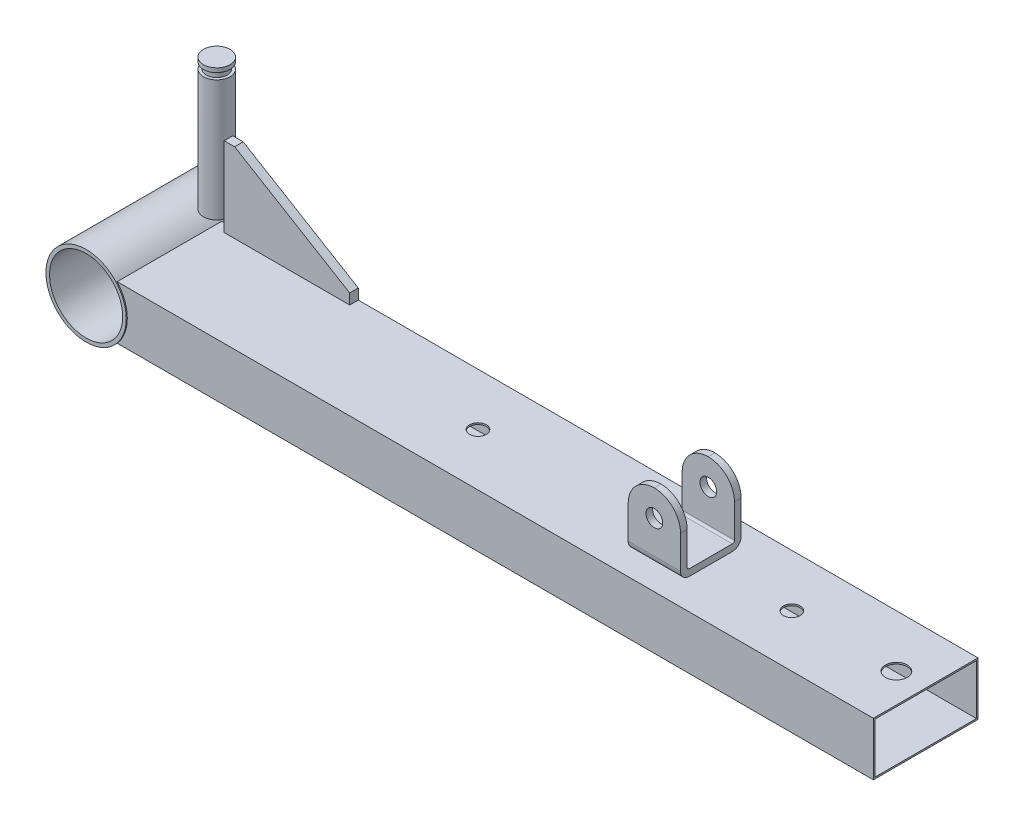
ISO-10303-21;
HEADER;
FILE_DESCRIPTION(('STEP AP214'),'2;1');
FILE_NAME('part.step','',(''),(''),'','','');
FILE_SCHEMA(('AUTOMOTIVE_DESIGN { 1 0 10303 214 1 1 1 1 }'));
ENDSEC;
DATA;
#1=APPLICATION_CONTEXT('core data for automotive mechanical design processes');
#2=APPLICATION_PROTOCOL_DEFINITION('international standard','automotive_design',2000,#1);
#3=PRODUCT_CONTEXT('',#1,'mechanical');
#4=PRODUCT('Part','Part','',(#3));
#5=PRODUCT_RELATED_PRODUCT_CATEGORY('part','',(#4));
#6=PRODUCT_DEFINITION_FORMATION('','',#4);
#7=PRODUCT_DEFINITION_CONTEXT('part definition',#1,'design');
#8=PRODUCT_DEFINITION('design','',#6,#7);
#9=PRODUCT_DEFINITION_SHAPE('','',#8);
#10=(LENGTH_UNIT() NAMED_UNIT(*) SI_UNIT(.MILLI.,.METRE.));
#11=(NAMED_UNIT(*) PLANE_ANGLE_UNIT() SI_UNIT($,.RADIAN.));
#12=(NAMED_UNIT(*) SI_UNIT($,.STERADIAN.) SOLID_ANGLE_UNIT());
#13=UNCERTAINTY_MEASURE_WITH_UNIT(LENGTH_MEASURE(1.E-05),#10,'distance_accuracy_value','');
#14=(GEOMETRIC_REPRESENTATION_CONTEXT(3) GLOBAL_UNCERTAINTY_ASSIGNED_CONTEXT((#13)) GLOBAL_UNIT_ASSIGNED_CONTEXT((#10,
#11,#12)) REPRESENTATION_CONTEXT('',''));
#15=CARTESIAN_POINT('',(0.,0.,0.));
#16=DIRECTION('',(0.,0.,1.));
#17=DIRECTION('',(1.,0.,0.));
#18=AXIS2_PLACEMENT_3D('',#15,#16,#17);
#19=CARTESIAN_POINT('',(0.,0.,74.3));
#20=DIRECTION('',(0.,0.,-1.));
#21=DIRECTION('',(-1.,0.,0.));
#22=AXIS2_PLACEMENT_3D('',#19,#20,#21);
#23=CYLINDRICAL_SURFACE('',#22,19.2);
#24=CARTESIAN_POINT('',(0.,0.,0.));
#25=DIRECTION('',(0.,0.,1.));
#26=DIRECTION('',(1.,0.,0.));
#27=AXIS2_PLACEMENT_3D('',#24,#25,#26);
#28=CIRCLE('',#27,19.2);
#29=CARTESIAN_POINT('',(19.2,0.,0.));
#30=VERTEX_POINT('',#29);
#31=EDGE_CURVE('E464',#30,#30,#28,.T.);
#32=ORIENTED_EDGE('',*,*,#31,.T.);
#33=EDGE_LOOP('',(#32));
#34=FACE_BOUND('',#33,.T.);
#35=CARTESIAN_POINT('',(0.,0.,74.3));
#36=DIRECTION('',(0.,0.,1.));
#37=DIRECTION('',(1.,0.,0.));
#38=AXIS2_PLACEMENT_3D('',#35,#36,#37);
#39=CIRCLE('',#38,19.2);
#40=CARTESIAN_POINT('',(19.2,0.,74.3));
#41=VERTEX_POINT('',#40);
#42=EDGE_CURVE('E467',#41,#41,#39,.T.);
#43=ORIENTED_EDGE('',*,*,#42,.F.);
#44=EDGE_LOOP('',(#43));
#45=FACE_BOUND('',#44,.T.);
#46=DIRECTION('',(0.,0.,-1.));
#47=VECTOR('',#46,1.);
#48=CARTESIAN_POINT('',(14.3553996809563,12.75,74.3));
#49=LINE('',#48,#47);
#50=CARTESIAN_POINT('',(14.3553996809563,12.75,23.8));
#51=VERTEX_POINT('',#50);
#52=CARTESIAN_POINT('',(14.3553996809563,12.75,73.8));
#53=VERTEX_POINT('',#52);
#54=EDGE_CURVE('E438',#51,#53,#49,.F.);
#55=ORIENTED_EDGE('',*,*,#54,.F.);
#56=CARTESIAN_POINT('',(0.,0.,23.8));
#57=DIRECTION('',(0.,0.,-1.));
#58=DIRECTION('',(0.,1.,0.));
#59=AXIS2_PLACEMENT_3D('',#56,#57,#58);
#60=CIRCLE('',#59,19.2);
#61=CARTESIAN_POINT('',(14.3553996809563,-12.75,23.8));
#62=VERTEX_POINT('',#61);
#63=EDGE_CURVE('E386',#62,#51,#60,.F.);
#64=ORIENTED_EDGE('',*,*,#63,.F.);
#65=DIRECTION('',(0.,0.,-1.));
#66=VECTOR('',#65,1.);
#67=CARTESIAN_POINT('',(14.3553996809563,-12.75,74.3));
#68=LINE('',#67,#66);
#69=CARTESIAN_POINT('',(14.3553996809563,-12.75,73.8));
#70=VERTEX_POINT('',#69);
#71=EDGE_CURVE('E435',#70,#62,#68,.T.);
#72=ORIENTED_EDGE('',*,*,#71,.F.);
#73=CARTESIAN_POINT('',(0.,0.,73.8));
#74=DIRECTION('',(0.,0.,1.));
#75=DIRECTION('',(1.,0.,0.));
#76=AXIS2_PLACEMENT_3D('',#73,#74,#75);
#77=CIRCLE('',#76,19.2);
#78=EDGE_CURVE('E447',#53,#70,#77,.F.);
#79=ORIENTED_EDGE('',*,*,#78,.F.);
#80=EDGE_LOOP('',(#55,#64,#72,#79));
#81=FACE_BOUND('',#80,.T.);
#82=CARTESIAN_POINT('',(7.31966529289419,17.75,22.484111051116));
#83=CARTESIAN_POINT('',(7.25426067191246,17.7769583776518,22.6356158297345));
#84=CARTESIAN_POINT('',(7.19462853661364,17.801138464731,22.7901054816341));
#85=CARTESIAN_POINT('',(7.08742070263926,17.8441006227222,23.1039403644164));
#86=CARTESIAN_POINT('',(7.03984486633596,17.8628827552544,23.2632855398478));
#87=CARTESIAN_POINT('',(6.95727368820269,17.8952026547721,23.5856657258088));
#88=CARTESIAN_POINT('',(6.92227405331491,17.9087422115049,23.7486994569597));
#89=CARTESIAN_POINT('',(6.86517591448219,17.9307084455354,24.0773429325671));
#90=CARTESIAN_POINT('',(6.84307688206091,17.9391353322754,24.2429525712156));
#91=CARTESIAN_POINT('',(6.81198484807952,17.9509648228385,24.5757192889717));
#92=CARTESIAN_POINT('',(6.80300307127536,17.9543631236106,24.7428775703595));
#93=CARTESIAN_POINT('',(6.79826854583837,17.9561563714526,25.077407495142));
#94=CARTESIAN_POINT('',(6.80251582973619,17.9545513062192,25.2447791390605));
#95=CARTESIAN_POINT('',(6.82418935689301,17.9463248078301,25.578384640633));
#96=CARTESIAN_POINT('',(6.84160287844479,17.9397082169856,25.7446194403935));
#97=CARTESIAN_POINT('',(6.88940823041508,17.9214035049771,26.0748635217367));
#98=CARTESIAN_POINT('',(6.91979624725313,17.9097168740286,26.2388734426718));
#99=CARTESIAN_POINT('',(6.99991924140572,17.878571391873,26.5929900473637));
#100=CARTESIAN_POINT('',(7.05215928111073,17.8580891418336,26.7824518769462));
#101=CARTESIAN_POINT('',(7.14317671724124,17.8217866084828,27.0615917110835));
#102=CARTESIAN_POINT('',(7.17561048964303,17.8087619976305,27.1537616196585));
#103=CARTESIAN_POINT('',(7.24458535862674,17.7808144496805,27.3362554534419));
#104=CARTESIAN_POINT('',(7.28112634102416,17.7658915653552,27.4265794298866));
#105=CARTESIAN_POINT('',(7.31966529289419,17.75,27.515888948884));
#106=B_SPLINE_CURVE_WITH_KNOTS('',3,(#82,#83,#84,#85,#86,#87,#88,#89,#90,#91,#92,#93,#94,#95,
#96,#97,#98,#99,#100,#101,#102,#103,#104,#105),.UNSPECIFIED.,.F.,.F.,(4,2,2,2,2,2,2,2,2,2,2,4),
(0.,0.501472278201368,1.00293883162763,1.50423403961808,2.00550871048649,2.50721208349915,
3.00891669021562,3.5101371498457,4.01121038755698,4.60290613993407,4.89852623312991,
5.19413810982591),.UNSPECIFIED.);
#107=CARTESIAN_POINT('',(7.31966529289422,17.75,22.4841110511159));
#108=VERTEX_POINT('',#107);
#109=CARTESIAN_POINT('',(7.31966529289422,17.75,27.5158889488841));
#110=VERTEX_POINT('',#109);
#111=EDGE_CURVE('E34',#108,#110,#106,.T.);
#112=ORIENTED_EDGE('',*,*,#111,.F.);
#113=DIRECTION('',(0.,0.,-1.));
#114=VECTOR('',#113,1.);
#115=CARTESIAN_POINT('',(7.31966529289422,17.75,74.3));
#116=LINE('',#115,#114);
#117=EDGE_CURVE('E58',#110,#108,#116,.T.);
#118=ORIENTED_EDGE('',*,*,#117,.F.);
#119=EDGE_LOOP('',(#112,#118));
#120=FACE_BOUND('',#119,.T.);
#121=ADVANCED_FACE('F30',(#34,#45,#81,#120),#23,.T.);
#122=CARTESIAN_POINT('',(-19.201,12.75,23.8));
#123=DIRECTION('',(0.,1.,0.));
#124=DIRECTION('',(0.,0.,1.));
#125=AXIS2_PLACEMENT_3D('',#122,#123,#124);
#126=PLANE('',#125);
#127=DIRECTION('',(0.,0.,-1.));
#128=VECTOR('',#127,1.);
#129=CARTESIAN_POINT('',(19.6,12.75,27.9));
#130=LINE('',#129,#128);
#131=CARTESIAN_POINT('',(19.6,12.75,27.9));
#132=VERTEX_POINT('',#131);
#133=CARTESIAN_POINT('',(19.6,12.75,23.8));
#134=VERTEX_POINT('',#133);
#135=EDGE_CURVE('E260',#132,#134,#130,.T.);
#136=ORIENTED_EDGE('',*,*,#135,.T.);
#137=DIRECTION('',(1.,0.,0.));
#138=VECTOR('',#137,1.);
#139=CARTESIAN_POINT('',(-19.201,12.75,23.8));
#140=LINE('',#139,#138);
#141=EDGE_CURVE('E245',#51,#134,#140,.T.);
#142=ORIENTED_EDGE('',*,*,#141,.F.);
#143=ORIENTED_EDGE('',*,*,#54,.T.);
#144=DIRECTION('',(1.,0.,0.));
#145=VECTOR('',#144,1.);
#146=CARTESIAN_POINT('',(-19.201,12.75,73.8));
#147=LINE('',#146,#145);
#148=CARTESIAN_POINT('',(375.8,12.75,73.8));
#149=VERTEX_POINT('',#148);
#150=EDGE_CURVE('E440',#53,#149,#147,.T.);
#151=ORIENTED_EDGE('',*,*,#150,.T.);
#152=DIRECTION('',(0.,0.,1.));
#153=VECTOR('',#152,1.);
#154=CARTESIAN_POINT('',(375.8,12.75,23.8));
#155=LINE('',#154,#153);
#156=CARTESIAN_POINT('',(375.8,12.75,23.8));
#157=VERTEX_POINT('',#156);
#158=EDGE_CURVE('E413',#157,#149,#155,.T.);
#159=ORIENTED_EDGE('',*,*,#158,.F.);
#160=CARTESIAN_POINT('',(79.6,12.75,23.8));
#161=VERTEX_POINT('',#160);
#162=EDGE_CURVE('E446',#161,#157,#140,.T.);
#163=ORIENTED_EDGE('',*,*,#162,.F.);
#164=DIRECTION('',(0.,0.,-1.));
#165=VECTOR('',#164,1.);
#166=CARTESIAN_POINT('',(79.6,12.75,27.9));
#167=LINE('',#166,#165);
#168=CARTESIAN_POINT('',(79.6,12.75,27.9));
#169=VERTEX_POINT('',#168);
#170=EDGE_CURVE('E263',#169,#161,#167,.T.);
#171=ORIENTED_EDGE('',*,*,#170,.F.);
#172=DIRECTION('',(-1.,0.,0.));
#173=VECTOR('',#172,1.);
#174=CARTESIAN_POINT('',(19.6,12.75,27.9));
#175=LINE('',#174,#173);
#176=EDGE_CURVE('E233',#169,#132,#175,.T.);
#177=ORIENTED_EDGE('',*,*,#176,.T.);
#178=EDGE_LOOP('',(#136,#142,#143,#151,#159,#163,#171,#177));
#179=FACE_BOUND('',#178,.T.);
#180=CARTESIAN_POINT('',(161.8,12.75,48.8));
#181=DIRECTION('',(0.,1.,0.));
#182=DIRECTION('',(0.,0.,1.));
#183=AXIS2_PLACEMENT_3D('',#180,#181,#182);
#184=CIRCLE('',#183,3.99999999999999);
#185=CARTESIAN_POINT('',(161.8,12.75,52.8));
#186=VERTEX_POINT('',#185);
#187=EDGE_CURVE('E273',#186,#186,#184,.T.);
#188=ORIENTED_EDGE('',*,*,#187,.F.);
#189=EDGE_LOOP('',(#188));
#190=FACE_BOUND('',#189,.T.);
#191=CARTESIAN_POINT('',(361.8,12.75,48.8));
#192=DIRECTION('',(0.,1.,0.));
#193=DIRECTION('',(0.,0.,1.));
#194=AXIS2_PLACEMENT_3D('',#191,#192,#193);
#195=CIRCLE('',#194,5.19999999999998);
#196=CARTESIAN_POINT('',(361.8,12.75,54.));
#197=VERTEX_POINT('',#196);
#198=EDGE_CURVE('E282',#197,#197,#195,.T.);
#199=ORIENTED_EDGE('',*,*,#198,.F.);
#200=EDGE_LOOP('',(#199));
#201=FACE_BOUND('',#200,.T.);
#202=CARTESIAN_POINT('',(311.8,12.75,48.8));
#203=DIRECTION('',(0.,1.,0.));
#204=DIRECTION('',(0.,0.,1.));
#205=AXIS2_PLACEMENT_3D('',#202,#203,#204);
#206=CIRCLE('',#205,3.99999999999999);
#207=CARTESIAN_POINT('',(311.8,12.75,52.8));
#208=VERTEX_POINT('',#207);
#209=EDGE_CURVE('E294',#208,#208,#206,.T.);
#210=ORIENTED_EDGE('',*,*,#209,.F.);
#211=EDGE_LOOP('',(#210));
#212=FACE_BOUND('',#211,.T.);
#213=DIRECTION('',(1.,0.,0.));
#214=VECTOR('',#213,1.);
#215=CARTESIAN_POINT('',(248.1,12.75,59.1));
#216=LINE('',#215,#214);
#217=CARTESIAN_POINT('',(248.1,12.75,59.1));
#218=VERTEX_POINT('',#217);
#219=CARTESIAN_POINT('',(273.1,12.75,59.1));
#220=VERTEX_POINT('',#219);
#221=EDGE_CURVE('E389',#218,#220,#216,.T.);
#222=ORIENTED_EDGE('',*,*,#221,.F.);
#223=DIRECTION('',(0.,0.,-1.));
#224=VECTOR('',#223,1.);
#225=CARTESIAN_POINT('',(248.1,12.75,59.1));
#226=LINE('',#225,#224);
#227=CARTESIAN_POINT('',(248.1,12.75,38.5));
#228=VERTEX_POINT('',#227);
#229=EDGE_CURVE('E375',#218,#228,#226,.T.);
#230=ORIENTED_EDGE('',*,*,#229,.T.);
#231=DIRECTION('',(1.,0.,0.));
#232=VECTOR('',#231,1.);
#233=CARTESIAN_POINT('',(248.1,12.75,38.5));
#234=LINE('',#233,#232);
#235=CARTESIAN_POINT('',(273.1,12.75,38.5));
#236=VERTEX_POINT('',#235);
#237=EDGE_CURVE('E387',#228,#236,#234,.T.);
#238=ORIENTED_EDGE('',*,*,#237,.T.);
#239=DIRECTION('',(0.,0.,-1.));
#240=VECTOR('',#239,1.);
#241=CARTESIAN_POINT('',(273.1,12.75,59.1));
#242=LINE('',#241,#240);
#243=EDGE_CURVE('E347',#220,#236,#242,.T.);
#244=ORIENTED_EDGE('',*,*,#243,.F.);
#245=EDGE_LOOP('',(#222,#230,#238,#244));
#246=FACE_BOUND('',#245,.T.);
#247=ADVANCED_FACE('F516',(#179,#190,#201,#212,#246),#126,.T.);
#248=CARTESIAN_POINT('',(0.,0.,74.3));
#249=DIRECTION('',(0.,0.,1.));
#250=DIRECTION('',(1.,0.,0.));
#251=AXIS2_PLACEMENT_3D('',#248,#249,#250);
#252=PLANE('',#251);
#253=ORIENTED_EDGE('',*,*,#42,.T.);
#254=EDGE_LOOP('',(#253));
#255=FACE_BOUND('',#254,.T.);
#256=CARTESIAN_POINT('',(0.,0.,74.3));
#257=DIRECTION('',(0.,0.,1.));
#258=DIRECTION('',(1.,0.,0.));
#259=AXIS2_PLACEMENT_3D('',#256,#257,#258);
#260=CIRCLE('',#259,17.5);
#261=CARTESIAN_POINT('',(17.5,0.,74.3));
#262=VERTEX_POINT('',#261);
#263=EDGE_CURVE('E461',#262,#262,#260,.T.);
#264=ORIENTED_EDGE('',*,*,#263,.F.);
#265=EDGE_LOOP('',(#264));
#266=FACE_BOUND('',#265,.T.);
#267=ADVANCED_FACE('F522',(#255,#266),#252,.T.);
#268=CARTESIAN_POINT('',(0.,0.,0.));
#269=DIRECTION('',(0.,0.,1.));
#270=DIRECTION('',(1.,0.,0.));
#271=AXIS2_PLACEMENT_3D('',#268,#269,#270);
#272=PLANE('',#271);
#273=ORIENTED_EDGE('',*,*,#31,.F.);
#274=EDGE_LOOP('',(#273));
#275=FACE_BOUND('',#274,.T.);
#276=CARTESIAN_POINT('',(0.,0.,0.));
#277=DIRECTION('',(0.,0.,1.));
#278=DIRECTION('',(1.,0.,0.));
#279=AXIS2_PLACEMENT_3D('',#276,#277,#278);
#280=CIRCLE('',#279,17.5);
#281=CARTESIAN_POINT('',(17.5,0.,0.));
#282=VERTEX_POINT('',#281);
#283=EDGE_CURVE('E444',#282,#282,#280,.T.);
#284=ORIENTED_EDGE('',*,*,#283,.T.);
#285=EDGE_LOOP('',(#284));
#286=FACE_BOUND('',#285,.T.);
#287=ADVANCED_FACE('F586',(#275,#286),#272,.F.);
#288=CARTESIAN_POINT('',(0.,0.,74.3));
#289=DIRECTION('',(0.,0.,-1.));
#290=DIRECTION('',(-1.,0.,0.));
#291=AXIS2_PLACEMENT_3D('',#288,#289,#290);
#292=CYLINDRICAL_SURFACE('',#291,17.5);
#293=ORIENTED_EDGE('',*,*,#263,.T.);
#294=EDGE_LOOP('',(#293));
#295=FACE_BOUND('',#294,.T.);
#296=ORIENTED_EDGE('',*,*,#283,.F.);
#297=EDGE_LOOP('',(#296));
#298=FACE_BOUND('',#297,.T.);
#299=ADVANCED_FACE('F583',(#295,#298),#292,.F.);
#300=CARTESIAN_POINT('',(-19.201,12.75,23.8));
#301=DIRECTION('',(0.,0.,-1.));
#302=DIRECTION('',(0.,1.,0.));
#303=AXIS2_PLACEMENT_3D('',#300,#301,#302);
#304=PLANE('',#303);
#305=DIRECTION('',(1.,0.,0.));
#306=VECTOR('',#305,1.);
#307=CARTESIAN_POINT('',(-19.201,-12.75,23.8));
#308=LINE('',#307,#306);
#309=CARTESIAN_POINT('',(375.8,-12.75,23.8));
#310=VERTEX_POINT('',#309);
#311=EDGE_CURVE('E437',#62,#310,#308,.T.);
#312=ORIENTED_EDGE('',*,*,#311,.F.);
#313=ORIENTED_EDGE('',*,*,#63,.T.);
#314=ORIENTED_EDGE('',*,*,#141,.T.);
#315=DIRECTION('',(0.,1.,0.));
#316=VECTOR('',#315,1.);
#317=CARTESIAN_POINT('',(19.6,12.75,23.8));
#318=LINE('',#317,#316);
#319=CARTESIAN_POINT('',(19.6,50.75,23.8));
#320=VERTEX_POINT('',#319);
#321=EDGE_CURVE('E225',#134,#320,#318,.T.);
#322=ORIENTED_EDGE('',*,*,#321,.T.);
#323=DIRECTION('',(1.,0.,0.));
#324=VECTOR('',#323,1.);
#325=CARTESIAN_POINT('',(19.6,50.75,23.8));
#326=LINE('',#325,#324);
#327=CARTESIAN_POINT('',(24.6,50.75,23.8));
#328=VERTEX_POINT('',#327);
#329=EDGE_CURVE('E236',#320,#328,#326,.T.);
#330=ORIENTED_EDGE('',*,*,#329,.T.);
#331=DIRECTION('',(0.857492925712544,-0.514495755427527,0.));
#332=VECTOR('',#331,1.);
#333=CARTESIAN_POINT('',(24.6,50.75,23.8));
#334=LINE('',#333,#332);
#335=CARTESIAN_POINT('',(79.6,17.75,23.8));
#336=VERTEX_POINT('',#335);
#337=EDGE_CURVE('E239',#328,#336,#334,.T.);
#338=ORIENTED_EDGE('',*,*,#337,.T.);
#339=DIRECTION('',(0.,-1.,0.));
#340=VECTOR('',#339,1.);
#341=CARTESIAN_POINT('',(79.6,12.75,23.8));
#342=LINE('',#341,#340);
#343=EDGE_CURVE('E51',#336,#161,#342,.T.);
#344=ORIENTED_EDGE('',*,*,#343,.T.);
#345=ORIENTED_EDGE('',*,*,#162,.T.);
#346=DIRECTION('',(0.,1.,0.));
#347=VECTOR('',#346,1.);
#348=CARTESIAN_POINT('',(375.8,12.75,23.8));
#349=LINE('',#348,#347);
#350=EDGE_CURVE('E416',#310,#157,#349,.T.);
#351=ORIENTED_EDGE('',*,*,#350,.F.);
#352=EDGE_LOOP('',(#312,#313,#314,#322,#330,#338,#344,#345,#351));
#353=FACE_BOUND('',#352,.T.);
#354=ADVANCED_FACE('F243',(#353),#304,.T.);
#355=CARTESIAN_POINT('',(-19.201,-12.75,23.8));
#356=DIRECTION('',(0.,-1.,0.));
#357=DIRECTION('',(0.,0.,-1.));
#358=AXIS2_PLACEMENT_3D('',#355,#356,#357);
#359=PLANE('',#358);
#360=CARTESIAN_POINT('',(161.8,-12.75,48.8));
#361=DIRECTION('',(0.,-1.,0.));
#362=DIRECTION('',(0.,0.,-1.));
#363=AXIS2_PLACEMENT_3D('',#360,#361,#362);
#364=CIRCLE('',#363,5.74999999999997);
#365=CARTESIAN_POINT('',(161.8,-12.75,43.05));
#366=VERTEX_POINT('',#365);
#367=EDGE_CURVE('E270',#366,#366,#364,.T.);
#368=ORIENTED_EDGE('',*,*,#367,.F.);
#369=EDGE_LOOP('',(#368));
#370=FACE_BOUND('',#369,.T.);
#371=CARTESIAN_POINT('',(311.8,-12.75,48.8));
#372=DIRECTION('',(0.,-1.,0.));
#373=DIRECTION('',(0.,0.,-1.));
#374=AXIS2_PLACEMENT_3D('',#371,#372,#373);
#375=CIRCLE('',#374,5.74999999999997);
#376=CARTESIAN_POINT('',(311.8,-12.75,43.05));
#377=VERTEX_POINT('',#376);
#378=EDGE_CURVE('E288',#377,#377,#375,.T.);
#379=ORIENTED_EDGE('',*,*,#378,.F.);
#380=EDGE_LOOP('',(#379));
#381=FACE_BOUND('',#380,.T.);
#382=DIRECTION('',(1.,0.,0.));
#383=VECTOR('',#382,1.);
#384=CARTESIAN_POINT('',(-19.201,-12.75,73.8));
#385=LINE('',#384,#383);
#386=CARTESIAN_POINT('',(375.8,-12.75,73.8));
#387=VERTEX_POINT('',#386);
#388=EDGE_CURVE('E441',#70,#387,#385,.T.);
#389=ORIENTED_EDGE('',*,*,#388,.F.);
#390=ORIENTED_EDGE('',*,*,#71,.T.);
#391=ORIENTED_EDGE('',*,*,#311,.T.);
#392=DIRECTION('',(0.,0.,-1.));
#393=VECTOR('',#392,1.);
#394=CARTESIAN_POINT('',(375.8,-12.75,23.8));
#395=LINE('',#394,#393);
#396=EDGE_CURVE('E407',#387,#310,#395,.T.);
#397=ORIENTED_EDGE('',*,*,#396,.F.);
#398=EDGE_LOOP('',(#389,#390,#391,#397));
#399=FACE_BOUND('',#398,.T.);
#400=ADVANCED_FACE('F576',(#370,#381,#399),#359,.T.);
#401=CARTESIAN_POINT('',(-19.201,12.75,73.8));
#402=DIRECTION('',(0.,0.,1.));
#403=DIRECTION('',(1.,0.,0.));
#404=AXIS2_PLACEMENT_3D('',#401,#402,#403);
#405=PLANE('',#404);
#406=ORIENTED_EDGE('',*,*,#150,.F.);
#407=ORIENTED_EDGE('',*,*,#78,.T.);
#408=ORIENTED_EDGE('',*,*,#388,.T.);
#409=DIRECTION('',(0.,-1.,0.));
#410=VECTOR('',#409,1.);
#411=CARTESIAN_POINT('',(375.8,12.75,73.8));
#412=LINE('',#411,#410);
#413=EDGE_CURVE('E410',#149,#387,#412,.T.);
#414=ORIENTED_EDGE('',*,*,#413,.F.);
#415=EDGE_LOOP('',(#406,#407,#408,#414));
#416=FACE_BOUND('',#415,.T.);
#417=ADVANCED_FACE('F568',(#416),#405,.T.);
#418=CARTESIAN_POINT('',(-19.201,12.,24.55));
#419=DIRECTION('',(0.,0.,-1.));
#420=DIRECTION('',(0.,1.,0.));
#421=AXIS2_PLACEMENT_3D('',#418,#419,#420);
#422=PLANE('',#421);
#423=CARTESIAN_POINT('',(0.,0.,24.55));
#424=DIRECTION('',(0.,0.,-1.));
#425=DIRECTION('',(0.,1.,0.));
#426=AXIS2_PLACEMENT_3D('',#423,#424,#425);
#427=CIRCLE('',#426,19.2);
#428=CARTESIAN_POINT('',(14.9879951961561,-12.,24.55));
#429=VERTEX_POINT('',#428);
#430=CARTESIAN_POINT('',(14.9879951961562,12.,24.55));
#431=VERTEX_POINT('',#430);
#432=EDGE_CURVE('E406',#429,#431,#427,.F.);
#433=ORIENTED_EDGE('',*,*,#432,.F.);
#434=DIRECTION('',(1.,0.,0.));
#435=VECTOR('',#434,1.);
#436=CARTESIAN_POINT('',(-19.201,-12.,24.55));
#437=LINE('',#436,#435);
#438=CARTESIAN_POINT('',(375.8,-12.,24.55));
#439=VERTEX_POINT('',#438);
#440=EDGE_CURVE('E434',#429,#439,#437,.T.);
#441=ORIENTED_EDGE('',*,*,#440,.T.);
#442=DIRECTION('',(0.,1.,0.));
#443=VECTOR('',#442,1.);
#444=CARTESIAN_POINT('',(375.8,12.,24.55));
#445=LINE('',#444,#443);
#446=CARTESIAN_POINT('',(375.8,12.,24.55));
#447=VERTEX_POINT('',#446);
#448=EDGE_CURVE('E431',#439,#447,#445,.T.);
#449=ORIENTED_EDGE('',*,*,#448,.T.);
#450=DIRECTION('',(1.,0.,0.));
#451=VECTOR('',#450,1.);
#452=CARTESIAN_POINT('',(-19.201,12.,24.55));
#453=LINE('',#452,#451);
#454=EDGE_CURVE('E428',#431,#447,#453,.T.);
#455=ORIENTED_EDGE('',*,*,#454,.F.);
#456=EDGE_LOOP('',(#433,#441,#449,#455));
#457=FACE_BOUND('',#456,.T.);
#458=ADVANCED_FACE('F549',(#457),#422,.F.);
#459=CARTESIAN_POINT('',(-19.201,-12.,24.55));
#460=DIRECTION('',(0.,-1.,0.));
#461=DIRECTION('',(0.,0.,-1.));
#462=AXIS2_PLACEMENT_3D('',#459,#460,#461);
#463=PLANE('',#462);
#464=CARTESIAN_POINT('',(161.8,-12.,48.8));
#465=DIRECTION('',(0.,-1.,0.));
#466=DIRECTION('',(0.,0.,-1.));
#467=AXIS2_PLACEMENT_3D('',#464,#465,#466);
#468=CIRCLE('',#467,5.74999999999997);
#469=CARTESIAN_POINT('',(161.8,-12.,43.05));
#470=VERTEX_POINT('',#469);
#471=EDGE_CURVE('E262',#470,#470,#468,.F.);
#472=ORIENTED_EDGE('',*,*,#471,.F.);
#473=EDGE_LOOP('',(#472));
#474=FACE_BOUND('',#473,.T.);
#475=CARTESIAN_POINT('',(311.8,-12.,48.8));
#476=DIRECTION('',(0.,-1.,0.));
#477=DIRECTION('',(0.,0.,-1.));
#478=AXIS2_PLACEMENT_3D('',#475,#476,#477);
#479=CIRCLE('',#478,5.74999999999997);
#480=CARTESIAN_POINT('',(311.8,-12.,43.05));
#481=VERTEX_POINT('',#480);
#482=EDGE_CURVE('E285',#481,#481,#479,.F.);
#483=ORIENTED_EDGE('',*,*,#482,.F.);
#484=EDGE_LOOP('',(#483));
#485=FACE_BOUND('',#484,.T.);
#486=DIRECTION('',(0.,0.,-1.));
#487=VECTOR('',#486,1.);
#488=CARTESIAN_POINT('',(14.9879951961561,-12.,74.3));
#489=LINE('',#488,#487);
#490=CARTESIAN_POINT('',(14.9879951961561,-12.,73.05));
#491=VERTEX_POINT('',#490);
#492=EDGE_CURVE('E442',#491,#429,#489,.T.);
#493=ORIENTED_EDGE('',*,*,#492,.F.);
#494=DIRECTION('',(1.,0.,0.));
#495=VECTOR('',#494,1.);
#496=CARTESIAN_POINT('',(-19.201,-12.,73.05));
#497=LINE('',#496,#495);
#498=CARTESIAN_POINT('',(375.8,-12.,73.05));
#499=VERTEX_POINT('',#498);
#500=EDGE_CURVE('E424',#491,#499,#497,.T.);
#501=ORIENTED_EDGE('',*,*,#500,.T.);
#502=DIRECTION('',(0.,0.,-1.));
#503=VECTOR('',#502,1.);
#504=CARTESIAN_POINT('',(375.8,-12.,24.55));
#505=LINE('',#504,#503);
#506=EDGE_CURVE('E420',#499,#439,#505,.T.);
#507=ORIENTED_EDGE('',*,*,#506,.T.);
#508=ORIENTED_EDGE('',*,*,#440,.F.);
#509=EDGE_LOOP('',(#493,#501,#507,#508));
#510=FACE_BOUND('',#509,.T.);
#511=ADVANCED_FACE('F559',(#474,#485,#510),#463,.F.);
#512=CARTESIAN_POINT('',(-19.201,12.,73.05));
#513=DIRECTION('',(0.,0.,1.));
#514=DIRECTION('',(1.,0.,0.));
#515=AXIS2_PLACEMENT_3D('',#512,#513,#514);
#516=PLANE('',#515);
#517=CARTESIAN_POINT('',(0.,0.,73.05));
#518=DIRECTION('',(0.,0.,1.));
#519=DIRECTION('',(1.,0.,0.));
#520=AXIS2_PLACEMENT_3D('',#517,#518,#519);
#521=CIRCLE('',#520,19.2);
#522=CARTESIAN_POINT('',(14.9879951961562,12.,73.05));
#523=VERTEX_POINT('',#522);
#524=EDGE_CURVE('E405',#523,#491,#521,.F.);
#525=ORIENTED_EDGE('',*,*,#524,.F.);
#526=DIRECTION('',(1.,0.,0.));
#527=VECTOR('',#526,1.);
#528=CARTESIAN_POINT('',(-19.201,12.,73.05));
#529=LINE('',#528,#527);
#530=CARTESIAN_POINT('',(375.8,12.,73.05));
#531=VERTEX_POINT('',#530);
#532=EDGE_CURVE('E423',#523,#531,#529,.T.);
#533=ORIENTED_EDGE('',*,*,#532,.T.);
#534=DIRECTION('',(0.,-1.,0.));
#535=VECTOR('',#534,1.);
#536=CARTESIAN_POINT('',(375.8,12.,73.05));
#537=LINE('',#536,#535);
#538=EDGE_CURVE('E425',#531,#499,#537,.T.);
#539=ORIENTED_EDGE('',*,*,#538,.T.);
#540=ORIENTED_EDGE('',*,*,#500,.F.);
#541=EDGE_LOOP('',(#525,#533,#539,#540));
#542=FACE_BOUND('',#541,.T.);
#543=ADVANCED_FACE('F557',(#542),#516,.F.);
#544=CARTESIAN_POINT('',(-19.201,12.,24.55));
#545=DIRECTION('',(0.,1.,0.));
#546=DIRECTION('',(0.,0.,1.));
#547=AXIS2_PLACEMENT_3D('',#544,#545,#546);
#548=PLANE('',#547);
#549=CARTESIAN_POINT('',(161.8,12.,48.8));
#550=DIRECTION('',(0.,1.,0.));
#551=DIRECTION('',(0.,0.,1.));
#552=AXIS2_PLACEMENT_3D('',#549,#550,#551);
#553=CIRCLE('',#552,3.99999999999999);
#554=CARTESIAN_POINT('',(161.8,12.,52.8));
#555=VERTEX_POINT('',#554);
#556=EDGE_CURVE('E276',#555,#555,#553,.F.);
#557=ORIENTED_EDGE('',*,*,#556,.F.);
#558=EDGE_LOOP('',(#557));
#559=FACE_BOUND('',#558,.T.);
#560=CARTESIAN_POINT('',(361.8,12.,48.8));
#561=DIRECTION('',(0.,1.,0.));
#562=DIRECTION('',(0.,0.,1.));
#563=AXIS2_PLACEMENT_3D('',#560,#561,#562);
#564=CIRCLE('',#563,5.19999999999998);
#565=CARTESIAN_POINT('',(361.8,12.,54.));
#566=VERTEX_POINT('',#565);
#567=EDGE_CURVE('E279',#566,#566,#564,.F.);
#568=ORIENTED_EDGE('',*,*,#567,.F.);
#569=EDGE_LOOP('',(#568));
#570=FACE_BOUND('',#569,.T.);
#571=CARTESIAN_POINT('',(311.8,12.,48.8));
#572=DIRECTION('',(0.,1.,0.));
#573=DIRECTION('',(0.,0.,1.));
#574=AXIS2_PLACEMENT_3D('',#571,#572,#573);
#575=CIRCLE('',#574,3.99999999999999);
#576=CARTESIAN_POINT('',(311.8,12.,52.8));
#577=VERTEX_POINT('',#576);
#578=EDGE_CURVE('E291',#577,#577,#575,.F.);
#579=ORIENTED_EDGE('',*,*,#578,.F.);
#580=EDGE_LOOP('',(#579));
#581=FACE_BOUND('',#580,.T.);
#582=DIRECTION('',(0.,0.,-1.));
#583=VECTOR('',#582,1.);
#584=CARTESIAN_POINT('',(14.9879951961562,12.,74.3));
#585=LINE('',#584,#583);
#586=EDGE_CURVE('E403',#431,#523,#585,.F.);
#587=ORIENTED_EDGE('',*,*,#586,.F.);
#588=ORIENTED_EDGE('',*,*,#454,.T.);
#589=DIRECTION('',(0.,0.,1.));
#590=VECTOR('',#589,1.);
#591=CARTESIAN_POINT('',(375.8,12.,24.55));
#592=LINE('',#591,#590);
#593=EDGE_CURVE('E419',#447,#531,#592,.T.);
#594=ORIENTED_EDGE('',*,*,#593,.T.);
#595=ORIENTED_EDGE('',*,*,#532,.F.);
#596=EDGE_LOOP('',(#587,#588,#594,#595));
#597=FACE_BOUND('',#596,.T.);
#598=ADVANCED_FACE('F537',(#559,#570,#581,#597),#548,.F.);
#599=CARTESIAN_POINT('',(375.8,-12.75,23.8));
#600=DIRECTION('',(-1.,0.,0.));
#601=DIRECTION('',(0.,0.,1.));
#602=AXIS2_PLACEMENT_3D('',#599,#600,#601);
#603=PLANE('',#602);
#604=ORIENTED_EDGE('',*,*,#593,.F.);
#605=ORIENTED_EDGE('',*,*,#448,.F.);
#606=ORIENTED_EDGE('',*,*,#506,.F.);
#607=ORIENTED_EDGE('',*,*,#538,.F.);
#608=EDGE_LOOP('',(#604,#605,#606,#607));
#609=FACE_BOUND('',#608,.T.);
#610=ORIENTED_EDGE('',*,*,#350,.T.);
#611=ORIENTED_EDGE('',*,*,#158,.T.);
#612=ORIENTED_EDGE('',*,*,#413,.T.);
#613=ORIENTED_EDGE('',*,*,#396,.T.);
#614=EDGE_LOOP('',(#610,#611,#612,#613));
#615=FACE_BOUND('',#614,.T.);
#616=ADVANCED_FACE('F528',(#609,#615),#603,.F.);
#617=ORIENTED_EDGE('',*,*,#432,.T.);
#618=ORIENTED_EDGE('',*,*,#586,.T.);
#619=ORIENTED_EDGE('',*,*,#524,.T.);
#620=ORIENTED_EDGE('',*,*,#492,.T.);
#621=EDGE_LOOP('',(#617,#618,#619,#620));
#622=FACE_BOUND('',#621,.T.);
#623=ADVANCED_FACE('F518',(#622),#23,.T.);
#624=CARTESIAN_POINT('',(248.1,16.95,34.3));
#625=DIRECTION('',(0.,0.,-1.));
#626=DIRECTION('',(-1.,0.,0.));
#627=AXIS2_PLACEMENT_3D('',#624,#625,#626);
#628=PLANE('',#627);
#629=CARTESIAN_POINT('',(260.6,32.75,34.3));
#630=DIRECTION('',(0.,0.,-1.));
#631=DIRECTION('',(-1.,0.,0.));
#632=AXIS2_PLACEMENT_3D('',#629,#630,#631);
#633=CIRCLE('',#632,3.99999999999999);
#634=CARTESIAN_POINT('',(256.6,32.75,34.3));
#635=VERTEX_POINT('',#634);
#636=EDGE_CURVE('E319',#635,#635,#633,.T.);
#637=ORIENTED_EDGE('',*,*,#636,.F.);
#638=EDGE_LOOP('',(#637));
#639=FACE_BOUND('',#638,.T.);
#640=CARTESIAN_POINT('',(260.6,32.75,34.3));
#641=DIRECTION('',(0.,0.,-1.));
#642=DIRECTION('',(-1.,0.,0.));
#643=AXIS2_PLACEMENT_3D('',#640,#641,#642);
#644=CIRCLE('',#643,12.5);
#645=CARTESIAN_POINT('',(248.1,32.75,34.3));
#646=VERTEX_POINT('',#645);
#647=CARTESIAN_POINT('',(260.6,45.25,34.3));
#648=VERTEX_POINT('',#647);
#649=EDGE_CURVE('E488',#646,#648,#644,.T.);
#650=ORIENTED_EDGE('',*,*,#649,.T.);
#651=CARTESIAN_POINT('',(260.6,32.75,34.3));
#652=DIRECTION('',(0.,0.,-1.));
#653=DIRECTION('',(-1.,0.,0.));
#654=AXIS2_PLACEMENT_3D('',#651,#652,#653);
#655=CIRCLE('',#654,12.5);
#656=CARTESIAN_POINT('',(273.1,32.75,34.3));
#657=VERTEX_POINT('',#656);
#658=EDGE_CURVE('E490',#648,#657,#655,.T.);
#659=ORIENTED_EDGE('',*,*,#658,.T.);
#660=DIRECTION('',(0.,1.,0.));
#661=VECTOR('',#660,1.);
#662=CARTESIAN_POINT('',(273.1,16.95,34.3));
#663=LINE('',#662,#661);
#664=CARTESIAN_POINT('',(273.1,16.95,34.3));
#665=VERTEX_POINT('',#664);
#666=EDGE_CURVE('E353',#665,#657,#663,.T.);
#667=ORIENTED_EDGE('',*,*,#666,.F.);
#668=DIRECTION('',(1.,0.,0.));
#669=VECTOR('',#668,1.);
#670=CARTESIAN_POINT('',(248.1,16.95,34.3));
#671=LINE('',#670,#669);
#672=CARTESIAN_POINT('',(248.1,16.95,34.3));
#673=VERTEX_POINT('',#672);
#674=EDGE_CURVE('E384',#673,#665,#671,.T.);
#675=ORIENTED_EDGE('',*,*,#674,.F.);
#676=DIRECTION('',(0.,1.,0.));
#677=VECTOR('',#676,1.);
#678=CARTESIAN_POINT('',(248.1,16.95,34.3));
#679=LINE('',#678,#677);
#680=EDGE_CURVE('E380',#673,#646,#679,.T.);
#681=ORIENTED_EDGE('',*,*,#680,.T.);
#682=EDGE_LOOP('',(#650,#659,#667,#675,#681));
#683=FACE_BOUND('',#682,.T.);
#684=ADVANCED_FACE('F527',(#639,#683),#628,.T.);
#685=CARTESIAN_POINT('',(248.1,16.95,38.5));
#686=DIRECTION('',(1.,0.,0.));
#687=DIRECTION('',(0.,0.,-1.));
#688=AXIS2_PLACEMENT_3D('',#685,#686,#687);
#689=CYLINDRICAL_SURFACE('',#688,4.2);
#690=CARTESIAN_POINT('',(273.1,16.95,38.5));
#691=DIRECTION('',(1.,0.,0.));
#692=DIRECTION('',(0.,0.,-1.));
#693=AXIS2_PLACEMENT_3D('',#690,#691,#692);
#694=CIRCLE('',#693,4.2);
#695=EDGE_CURVE('E350',#236,#665,#694,.T.);
#696=ORIENTED_EDGE('',*,*,#695,.F.);
#697=ORIENTED_EDGE('',*,*,#237,.F.);
#698=CARTESIAN_POINT('',(248.1,16.95,38.5));
#699=DIRECTION('',(1.,0.,0.));
#700=DIRECTION('',(0.,0.,-1.));
#701=AXIS2_PLACEMENT_3D('',#698,#699,#700);
#702=CIRCLE('',#701,4.2);
#703=EDGE_CURVE('E377',#228,#673,#702,.T.);
#704=ORIENTED_EDGE('',*,*,#703,.T.);
#705=ORIENTED_EDGE('',*,*,#674,.T.);
#706=EDGE_LOOP('',(#696,#697,#704,#705));
#707=FACE_BOUND('',#706,.T.);
#708=ADVANCED_FACE('F534',(#707),#689,.T.);
#709=CARTESIAN_POINT('',(248.1,16.95,59.1));
#710=DIRECTION('',(1.,0.,0.));
#711=DIRECTION('',(0.,0.,-1.));
#712=AXIS2_PLACEMENT_3D('',#709,#710,#711);
#713=CYLINDRICAL_SURFACE('',#712,4.2);
#714=CARTESIAN_POINT('',(273.1,16.95,59.1));
#715=DIRECTION('',(1.,0.,0.));
#716=DIRECTION('',(0.,0.,1.));
#717=AXIS2_PLACEMENT_3D('',#714,#715,#716);
#718=CIRCLE('',#717,4.2);
#719=CARTESIAN_POINT('',(273.1,16.95,63.3));
#720=VERTEX_POINT('',#719);
#721=EDGE_CURVE('E344',#720,#220,#718,.T.);
#722=ORIENTED_EDGE('',*,*,#721,.F.);
#723=DIRECTION('',(1.,0.,0.));
#724=VECTOR('',#723,1.);
#725=CARTESIAN_POINT('',(248.1,16.95,63.3));
#726=LINE('',#725,#724);
#727=CARTESIAN_POINT('',(248.1,16.95,63.3));
#728=VERTEX_POINT('',#727);
#729=EDGE_CURVE('E392',#728,#720,#726,.T.);
#730=ORIENTED_EDGE('',*,*,#729,.F.);
#731=CARTESIAN_POINT('',(248.1,16.95,59.1));
#732=DIRECTION('',(1.,0.,0.));
#733=DIRECTION('',(0.,0.,1.));
#734=AXIS2_PLACEMENT_3D('',#731,#732,#733);
#735=CIRCLE('',#734,4.2);
#736=EDGE_CURVE('E372',#728,#218,#735,.T.);
#737=ORIENTED_EDGE('',*,*,#736,.T.);
#738=ORIENTED_EDGE('',*,*,#221,.T.);
#739=EDGE_LOOP('',(#722,#730,#737,#738));
#740=FACE_BOUND('',#739,.T.);
#741=ADVANCED_FACE('F912',(#740),#713,.T.);
#742=CARTESIAN_POINT('',(248.1,16.95,63.3));
#743=DIRECTION('',(0.,0.,1.));
#744=DIRECTION('',(1.,0.,0.));
#745=AXIS2_PLACEMENT_3D('',#742,#743,#744);
#746=PLANE('',#745);
#747=CARTESIAN_POINT('',(260.6,32.75,63.3));
#748=DIRECTION('',(0.,0.,1.));
#749=DIRECTION('',(1.,0.,0.));
#750=AXIS2_PLACEMENT_3D('',#747,#748,#749);
#751=CIRCLE('',#750,3.99999999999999);
#752=CARTESIAN_POINT('',(264.6,32.75,63.3));
#753=VERTEX_POINT('',#752);
#754=EDGE_CURVE('E312',#753,#753,#751,.T.);
#755=ORIENTED_EDGE('',*,*,#754,.F.);
#756=EDGE_LOOP('',(#755));
#757=FACE_BOUND('',#756,.T.);
#758=DIRECTION('',(0.,-1.,0.));
#759=VECTOR('',#758,1.);
#760=CARTESIAN_POINT('',(273.1,16.95,63.3));
#761=LINE('',#760,#759);
#762=CARTESIAN_POINT('',(273.1,32.75,63.3));
#763=VERTEX_POINT('',#762);
#764=EDGE_CURVE('E342',#763,#720,#761,.T.);
#765=ORIENTED_EDGE('',*,*,#764,.F.);
#766=CARTESIAN_POINT('',(260.6,32.75,63.3));
#767=DIRECTION('',(0.,0.,1.));
#768=DIRECTION('',(1.,0.,0.));
#769=AXIS2_PLACEMENT_3D('',#766,#767,#768);
#770=CIRCLE('',#769,12.5);
#771=CARTESIAN_POINT('',(260.6,45.25,63.3));
#772=VERTEX_POINT('',#771);
#773=EDGE_CURVE('E478',#763,#772,#770,.T.);
#774=ORIENTED_EDGE('',*,*,#773,.T.);
#775=CARTESIAN_POINT('',(260.6,32.75,63.3));
#776=DIRECTION('',(0.,0.,1.));
#777=DIRECTION('',(1.,0.,0.));
#778=AXIS2_PLACEMENT_3D('',#775,#776,#777);
#779=CIRCLE('',#778,12.5);
#780=CARTESIAN_POINT('',(248.1,32.75,63.3));
#781=VERTEX_POINT('',#780);
#782=EDGE_CURVE('E476',#772,#781,#779,.T.);
#783=ORIENTED_EDGE('',*,*,#782,.T.);
#784=DIRECTION('',(0.,-1.,0.));
#785=VECTOR('',#784,1.);
#786=CARTESIAN_POINT('',(248.1,16.95,63.3));
#787=LINE('',#786,#785);
#788=EDGE_CURVE('E370',#781,#728,#787,.T.);
#789=ORIENTED_EDGE('',*,*,#788,.T.);
#790=ORIENTED_EDGE('',*,*,#729,.T.);
#791=EDGE_LOOP('',(#765,#774,#783,#789,#790));
#792=FACE_BOUND('',#791,.T.);
#793=ADVANCED_FACE('F903',(#757,#792),#746,.T.);
#794=CARTESIAN_POINT('',(248.1,16.95,60.1));
#795=DIRECTION('',(0.,0.,-1.));
#796=DIRECTION('',(-1.,0.,0.));
#797=AXIS2_PLACEMENT_3D('',#794,#795,#796);
#798=PLANE('',#797);
#799=CARTESIAN_POINT('',(260.6,32.75,60.1));
#800=DIRECTION('',(0.,0.,-1.));
#801=DIRECTION('',(-1.,0.,0.));
#802=AXIS2_PLACEMENT_3D('',#799,#800,#801);
#803=CIRCLE('',#802,3.99999999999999);
#804=CARTESIAN_POINT('',(256.6,32.75,60.1));
#805=VERTEX_POINT('',#804);
#806=EDGE_CURVE('E316',#805,#805,#803,.T.);
#807=ORIENTED_EDGE('',*,*,#806,.F.);
#808=EDGE_LOOP('',(#807));
#809=FACE_BOUND('',#808,.T.);
#810=CARTESIAN_POINT('',(260.6,32.75,60.1));
#811=DIRECTION('',(0.,0.,-1.));
#812=DIRECTION('',(-1.,0.,0.));
#813=AXIS2_PLACEMENT_3D('',#810,#811,#812);
#814=CIRCLE('',#813,12.5);
#815=CARTESIAN_POINT('',(248.1,32.75,60.1));
#816=VERTEX_POINT('',#815);
#817=CARTESIAN_POINT('',(260.6,45.25,60.1));
#818=VERTEX_POINT('',#817);
#819=EDGE_CURVE('E480',#816,#818,#814,.T.);
#820=ORIENTED_EDGE('',*,*,#819,.T.);
#821=CARTESIAN_POINT('',(260.6,32.75,60.1));
#822=DIRECTION('',(0.,0.,-1.));
#823=DIRECTION('',(-1.,0.,0.));
#824=AXIS2_PLACEMENT_3D('',#821,#822,#823);
#825=CIRCLE('',#824,12.5);
#826=CARTESIAN_POINT('',(273.1,32.75,60.1));
#827=VERTEX_POINT('',#826);
#828=EDGE_CURVE('E482',#818,#827,#825,.T.);
#829=ORIENTED_EDGE('',*,*,#828,.T.);
#830=DIRECTION('',(0.,1.,0.));
#831=VECTOR('',#830,1.);
#832=CARTESIAN_POINT('',(273.1,16.95,60.1));
#833=LINE('',#832,#831);
#834=CARTESIAN_POINT('',(273.1,16.95,60.1));
#835=VERTEX_POINT('',#834);
#836=EDGE_CURVE('E339',#835,#827,#833,.T.);
#837=ORIENTED_EDGE('',*,*,#836,.F.);
#838=DIRECTION('',(1.,0.,0.));
#839=VECTOR('',#838,1.);
#840=CARTESIAN_POINT('',(248.1,16.95,60.1));
#841=LINE('',#840,#839);
#842=CARTESIAN_POINT('',(248.1,16.95,60.1));
#843=VERTEX_POINT('',#842);
#844=EDGE_CURVE('E395',#843,#835,#841,.T.);
#845=ORIENTED_EDGE('',*,*,#844,.F.);
#846=DIRECTION('',(0.,1.,0.));
#847=VECTOR('',#846,1.);
#848=CARTESIAN_POINT('',(248.1,16.95,60.1));
#849=LINE('',#848,#847);
#850=EDGE_CURVE('E367',#843,#816,#849,.T.);
#851=ORIENTED_EDGE('',*,*,#850,.T.);
#852=EDGE_LOOP('',(#820,#829,#837,#845,#851));
#853=FACE_BOUND('',#852,.T.);
#854=ADVANCED_FACE('F894',(#809,#853),#798,.T.);
#855=CARTESIAN_POINT('',(248.1,16.95,59.1));
#856=DIRECTION('',(1.,0.,0.));
#857=DIRECTION('',(0.,0.,-1.));
#858=AXIS2_PLACEMENT_3D('',#855,#856,#857);
#859=CYLINDRICAL_SURFACE('',#858,1.);
#860=CARTESIAN_POINT('',(273.1,16.95,59.1));
#861=DIRECTION('',(-1.,0.,0.));
#862=DIRECTION('',(0.,0.,-1.));
#863=AXIS2_PLACEMENT_3D('',#860,#861,#862);
#864=CIRCLE('',#863,1.);
#865=CARTESIAN_POINT('',(273.1,15.95,59.1));
#866=VERTEX_POINT('',#865);
#867=EDGE_CURVE('E336',#866,#835,#864,.T.);
#868=ORIENTED_EDGE('',*,*,#867,.F.);
#869=DIRECTION('',(1.,0.,0.));
#870=VECTOR('',#869,1.);
#871=CARTESIAN_POINT('',(248.1,15.95,59.1));
#872=LINE('',#871,#870);
#873=CARTESIAN_POINT('',(248.1,15.95,59.1));
#874=VERTEX_POINT('',#873);
#875=EDGE_CURVE('E397',#874,#866,#872,.T.);
#876=ORIENTED_EDGE('',*,*,#875,.F.);
#877=CARTESIAN_POINT('',(248.1,16.95,59.1));
#878=DIRECTION('',(-1.,0.,0.));
#879=DIRECTION('',(0.,0.,-1.));
#880=AXIS2_PLACEMENT_3D('',#877,#878,#879);
#881=CIRCLE('',#880,1.);
#882=EDGE_CURVE('E364',#874,#843,#881,.T.);
#883=ORIENTED_EDGE('',*,*,#882,.T.);
#884=ORIENTED_EDGE('',*,*,#844,.T.);
#885=EDGE_LOOP('',(#868,#876,#883,#884));
#886=FACE_BOUND('',#885,.T.);
#887=ADVANCED_FACE('F885',(#886),#859,.F.);
#888=CARTESIAN_POINT('',(248.1,15.95,59.1));
#889=DIRECTION('',(0.,1.,0.));
#890=DIRECTION('',(0.,0.,1.));
#891=AXIS2_PLACEMENT_3D('',#888,#889,#890);
#892=PLANE('',#891);
#893=DIRECTION('',(0.,0.,1.));
#894=VECTOR('',#893,1.);
#895=CARTESIAN_POINT('',(273.1,15.95,59.1));
#896=LINE('',#895,#894);
#897=CARTESIAN_POINT('',(273.1,15.95,38.5));
#898=VERTEX_POINT('',#897);
#899=EDGE_CURVE('E333',#898,#866,#896,.T.);
#900=ORIENTED_EDGE('',*,*,#899,.F.);
#901=DIRECTION('',(1.,0.,0.));
#902=VECTOR('',#901,1.);
#903=CARTESIAN_POINT('',(248.1,15.95,38.5));
#904=LINE('',#903,#902);
#905=CARTESIAN_POINT('',(248.1,15.95,38.5));
#906=VERTEX_POINT('',#905);
#907=EDGE_CURVE('E399',#906,#898,#904,.T.);
#908=ORIENTED_EDGE('',*,*,#907,.F.);
#909=DIRECTION('',(0.,0.,1.));
#910=VECTOR('',#909,1.);
#911=CARTESIAN_POINT('',(248.1,15.95,59.1));
#912=LINE('',#911,#910);
#913=EDGE_CURVE('E361',#906,#874,#912,.T.);
#914=ORIENTED_EDGE('',*,*,#913,.T.);
#915=ORIENTED_EDGE('',*,*,#875,.T.);
#916=EDGE_LOOP('',(#900,#908,#914,#915));
#917=FACE_BOUND('',#916,.T.);
#918=ADVANCED_FACE('F876',(#917),#892,.T.);
#919=CARTESIAN_POINT('',(248.1,16.95,38.5));
#920=DIRECTION('',(1.,0.,0.));
#921=DIRECTION('',(0.,0.,-1.));
#922=AXIS2_PLACEMENT_3D('',#919,#920,#921);
#923=CYLINDRICAL_SURFACE('',#922,1.);
#924=CARTESIAN_POINT('',(273.1,16.95,38.5));
#925=DIRECTION('',(-1.,0.,0.));
#926=DIRECTION('',(0.,0.,-1.));
#927=AXIS2_PLACEMENT_3D('',#924,#925,#926);
#928=CIRCLE('',#927,1.);
#929=CARTESIAN_POINT('',(273.1,16.95,37.5));
#930=VERTEX_POINT('',#929);
#931=EDGE_CURVE('E330',#930,#898,#928,.T.);
#932=ORIENTED_EDGE('',*,*,#931,.F.);
#933=DIRECTION('',(1.,0.,0.));
#934=VECTOR('',#933,1.);
#935=CARTESIAN_POINT('',(248.1,16.95,37.5));
#936=LINE('',#935,#934);
#937=CARTESIAN_POINT('',(248.1,16.95,37.5));
#938=VERTEX_POINT('',#937);
#939=EDGE_CURVE('E383',#938,#930,#936,.T.);
#940=ORIENTED_EDGE('',*,*,#939,.F.);
#941=CARTESIAN_POINT('',(248.1,16.95,38.5));
#942=DIRECTION('',(-1.,0.,0.));
#943=DIRECTION('',(0.,0.,-1.));
#944=AXIS2_PLACEMENT_3D('',#941,#942,#943);
#945=CIRCLE('',#944,1.);
#946=EDGE_CURVE('E358',#938,#906,#945,.T.);
#947=ORIENTED_EDGE('',*,*,#946,.T.);
#948=ORIENTED_EDGE('',*,*,#907,.T.);
#949=EDGE_LOOP('',(#932,#940,#947,#948));
#950=FACE_BOUND('',#949,.T.);
#951=ADVANCED_FACE('F867',(#950),#923,.F.);
#952=CARTESIAN_POINT('',(248.1,16.95,37.5));
#953=DIRECTION('',(0.,0.,1.));
#954=DIRECTION('',(1.,0.,0.));
#955=AXIS2_PLACEMENT_3D('',#952,#953,#954);
#956=PLANE('',#955);
#957=CARTESIAN_POINT('',(260.6,32.75,37.5));
#958=DIRECTION('',(0.,0.,1.));
#959=DIRECTION('',(1.,0.,0.));
#960=AXIS2_PLACEMENT_3D('',#957,#958,#959);
#961=CIRCLE('',#960,3.99999999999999);
#962=CARTESIAN_POINT('',(264.6,32.75,37.5));
#963=VERTEX_POINT('',#962);
#964=EDGE_CURVE('E315',#963,#963,#961,.T.);
#965=ORIENTED_EDGE('',*,*,#964,.F.);
#966=EDGE_LOOP('',(#965));
#967=FACE_BOUND('',#966,.T.);
#968=DIRECTION('',(0.,-1.,0.));
#969=VECTOR('',#968,1.);
#970=CARTESIAN_POINT('',(273.1,16.95,37.5));
#971=LINE('',#970,#969);
#972=CARTESIAN_POINT('',(273.1,32.75,37.5));
#973=VERTEX_POINT('',#972);
#974=EDGE_CURVE('E328',#973,#930,#971,.T.);
#975=ORIENTED_EDGE('',*,*,#974,.F.);
#976=CARTESIAN_POINT('',(260.6,32.75,37.5));
#977=DIRECTION('',(0.,0.,1.));
#978=DIRECTION('',(1.,0.,0.));
#979=AXIS2_PLACEMENT_3D('',#976,#977,#978);
#980=CIRCLE('',#979,12.5);
#981=CARTESIAN_POINT('',(260.6,45.25,37.5));
#982=VERTEX_POINT('',#981);
#983=EDGE_CURVE('E486',#973,#982,#980,.T.);
#984=ORIENTED_EDGE('',*,*,#983,.T.);
#985=CARTESIAN_POINT('',(260.6,32.75,37.5));
#986=DIRECTION('',(0.,0.,1.));
#987=DIRECTION('',(1.,0.,0.));
#988=AXIS2_PLACEMENT_3D('',#985,#986,#987);
#989=CIRCLE('',#988,12.5);
#990=CARTESIAN_POINT('',(248.1,32.75,37.5));
#991=VERTEX_POINT('',#990);
#992=EDGE_CURVE('E484',#982,#991,#989,.T.);
#993=ORIENTED_EDGE('',*,*,#992,.T.);
#994=DIRECTION('',(0.,-1.,0.));
#995=VECTOR('',#994,1.);
#996=CARTESIAN_POINT('',(248.1,16.95,37.5));
#997=LINE('',#996,#995);
#998=EDGE_CURVE('E356',#991,#938,#997,.T.);
#999=ORIENTED_EDGE('',*,*,#998,.T.);
#1000=ORIENTED_EDGE('',*,*,#939,.T.);
#1001=EDGE_LOOP('',(#975,#984,#993,#999,#1000));
#1002=FACE_BOUND('',#1001,.T.);
#1003=ADVANCED_FACE('F858',(#967,#1002),#956,.T.);
#1004=CARTESIAN_POINT('',(248.1,16.95,38.5));
#1005=DIRECTION('',(1.,0.,0.));
#1006=DIRECTION('',(0.,0.,-1.));
#1007=AXIS2_PLACEMENT_3D('',#1004,#1005,#1006);
#1008=PLANE('',#1007);
#1009=ORIENTED_EDGE('',*,*,#788,.F.);
#1010=DIRECTION('',(0.,0.,1.));
#1011=VECTOR('',#1010,1.);
#1012=CARTESIAN_POINT('',(248.1,32.75,63.3));
#1013=LINE('',#1012,#1011);
#1014=EDGE_CURVE('E494',#781,#816,#1013,.F.);
#1015=ORIENTED_EDGE('',*,*,#1014,.T.);
#1016=ORIENTED_EDGE('',*,*,#850,.F.);
#1017=ORIENTED_EDGE('',*,*,#882,.F.);
#1018=ORIENTED_EDGE('',*,*,#913,.F.);
#1019=ORIENTED_EDGE('',*,*,#946,.F.);
#1020=ORIENTED_EDGE('',*,*,#998,.F.);
#1021=DIRECTION('',(0.,0.,1.));
#1022=VECTOR('',#1021,1.);
#1023=CARTESIAN_POINT('',(248.1,32.75,37.5));
#1024=LINE('',#1023,#1022);
#1025=EDGE_CURVE('E492',#991,#646,#1024,.F.);
#1026=ORIENTED_EDGE('',*,*,#1025,.T.);
#1027=ORIENTED_EDGE('',*,*,#680,.F.);
#1028=ORIENTED_EDGE('',*,*,#703,.F.);
#1029=ORIENTED_EDGE('',*,*,#229,.F.);
#1030=ORIENTED_EDGE('',*,*,#736,.F.);
#1031=EDGE_LOOP('',(#1009,#1015,#1016,#1017,#1018,#1019,#1020,#1026,#1027,#1028,#1029,#1030));
#1032=FACE_BOUND('',#1031,.T.);
#1033=ADVANCED_FACE('F849',(#1032),#1008,.F.);
#1034=CARTESIAN_POINT('',(273.1,16.95,38.5));
#1035=DIRECTION('',(1.,0.,0.));
#1036=DIRECTION('',(0.,0.,-1.));
#1037=AXIS2_PLACEMENT_3D('',#1034,#1035,#1036);
#1038=PLANE('',#1037);
#1039=ORIENTED_EDGE('',*,*,#836,.T.);
#1040=DIRECTION('',(0.,0.,1.));
#1041=VECTOR('',#1040,1.);
#1042=CARTESIAN_POINT('',(273.1,32.75,38.5));
#1043=LINE('',#1042,#1041);
#1044=EDGE_CURVE('E473',#827,#763,#1043,.T.);
#1045=ORIENTED_EDGE('',*,*,#1044,.T.);
#1046=ORIENTED_EDGE('',*,*,#764,.T.);
#1047=ORIENTED_EDGE('',*,*,#721,.T.);
#1048=ORIENTED_EDGE('',*,*,#243,.T.);
#1049=ORIENTED_EDGE('',*,*,#695,.T.);
#1050=ORIENTED_EDGE('',*,*,#666,.T.);
#1051=DIRECTION('',(0.,0.,1.));
#1052=VECTOR('',#1051,1.);
#1053=CARTESIAN_POINT('',(273.1,32.75,38.5));
#1054=LINE('',#1053,#1052);
#1055=EDGE_CURVE('E470',#657,#973,#1054,.T.);
#1056=ORIENTED_EDGE('',*,*,#1055,.T.);
#1057=ORIENTED_EDGE('',*,*,#974,.T.);
#1058=ORIENTED_EDGE('',*,*,#931,.T.);
#1059=ORIENTED_EDGE('',*,*,#899,.T.);
#1060=ORIENTED_EDGE('',*,*,#867,.T.);
#1061=EDGE_LOOP('',(#1039,#1045,#1046,#1047,#1048,#1049,#1050,#1056,#1057,#1058,#1059,#1060));
#1062=FACE_BOUND('',#1061,.T.);
#1063=ADVANCED_FACE('F840',(#1062),#1038,.T.);
#1064=CARTESIAN_POINT('',(260.6,32.75,63.3));
#1065=DIRECTION('',(0.,0.,-1.));
#1066=DIRECTION('',(-1.,0.,0.));
#1067=AXIS2_PLACEMENT_3D('',#1064,#1065,#1066);
#1068=CYLINDRICAL_SURFACE('',#1067,12.5);
#1069=DIRECTION('',(0.,0.,1.));
#1070=VECTOR('',#1069,1.);
#1071=CARTESIAN_POINT('',(260.6,45.25,63.3));
#1072=LINE('',#1071,#1070);
#1073=EDGE_CURVE('E325',#818,#772,#1072,.T.);
#1074=ORIENTED_EDGE('',*,*,#1073,.F.);
#1075=ORIENTED_EDGE('',*,*,#819,.F.);
#1076=ORIENTED_EDGE('',*,*,#1014,.F.);
#1077=ORIENTED_EDGE('',*,*,#782,.F.);
#1078=EDGE_LOOP('',(#1074,#1075,#1076,#1077));
#1079=FACE_BOUND('',#1078,.T.);
#1080=ADVANCED_FACE('F831',(#1079),#1068,.T.);
#1081=CARTESIAN_POINT('',(260.6,32.75,38.5));
#1082=DIRECTION('',(0.,0.,1.));
#1083=DIRECTION('',(1.,0.,0.));
#1084=AXIS2_PLACEMENT_3D('',#1081,#1082,#1083);
#1085=CYLINDRICAL_SURFACE('',#1084,12.5);
#1086=ORIENTED_EDGE('',*,*,#828,.F.);
#1087=ORIENTED_EDGE('',*,*,#1073,.T.);
#1088=ORIENTED_EDGE('',*,*,#773,.F.);
#1089=ORIENTED_EDGE('',*,*,#1044,.F.);
#1090=EDGE_LOOP('',(#1086,#1087,#1088,#1089));
#1091=FACE_BOUND('',#1090,.T.);
#1092=ADVANCED_FACE('F822',(#1091),#1085,.T.);
#1093=CARTESIAN_POINT('',(260.6,32.75,37.5));
#1094=DIRECTION('',(0.,0.,-1.));
#1095=DIRECTION('',(-1.,0.,0.));
#1096=AXIS2_PLACEMENT_3D('',#1093,#1094,#1095);
#1097=CYLINDRICAL_SURFACE('',#1096,12.5);
#1098=DIRECTION('',(0.,0.,1.));
#1099=VECTOR('',#1098,1.);
#1100=CARTESIAN_POINT('',(260.6,45.25,37.5));
#1101=LINE('',#1100,#1099);
#1102=EDGE_CURVE('E322',#648,#982,#1101,.T.);
#1103=ORIENTED_EDGE('',*,*,#1102,.F.);
#1104=ORIENTED_EDGE('',*,*,#649,.F.);
#1105=ORIENTED_EDGE('',*,*,#1025,.F.);
#1106=ORIENTED_EDGE('',*,*,#992,.F.);
#1107=EDGE_LOOP('',(#1103,#1104,#1105,#1106));
#1108=FACE_BOUND('',#1107,.T.);
#1109=ADVANCED_FACE('F813',(#1108),#1097,.T.);
#1110=CARTESIAN_POINT('',(260.6,32.75,38.5));
#1111=DIRECTION('',(0.,0.,1.));
#1112=DIRECTION('',(1.,0.,0.));
#1113=AXIS2_PLACEMENT_3D('',#1110,#1111,#1112);
#1114=CYLINDRICAL_SURFACE('',#1113,12.5);
#1115=ORIENTED_EDGE('',*,*,#658,.F.);
#1116=ORIENTED_EDGE('',*,*,#1102,.T.);
#1117=ORIENTED_EDGE('',*,*,#983,.F.);
#1118=ORIENTED_EDGE('',*,*,#1055,.F.);
#1119=EDGE_LOOP('',(#1115,#1116,#1117,#1118));
#1120=FACE_BOUND('',#1119,.T.);
#1121=ADVANCED_FACE('F805',(#1120),#1114,.T.);
#1122=CARTESIAN_POINT('',(260.6,32.75,0.));
#1123=DIRECTION('',(0.,0.,1.));
#1124=DIRECTION('',(1.,0.,0.));
#1125=AXIS2_PLACEMENT_3D('',#1122,#1123,#1124);
#1126=CYLINDRICAL_SURFACE('',#1125,3.99999999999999);
#1127=ORIENTED_EDGE('',*,*,#636,.T.);
#1128=EDGE_LOOP('',(#1127));
#1129=FACE_BOUND('',#1128,.T.);
#1130=ORIENTED_EDGE('',*,*,#964,.T.);
#1131=EDGE_LOOP('',(#1130));
#1132=FACE_BOUND('',#1131,.T.);
#1133=ADVANCED_FACE('F796',(#1129,#1132),#1126,.F.);
#1134=ORIENTED_EDGE('',*,*,#806,.T.);
#1135=EDGE_LOOP('',(#1134));
#1136=FACE_BOUND('',#1135,.T.);
#1137=ORIENTED_EDGE('',*,*,#754,.T.);
#1138=EDGE_LOOP('',(#1137));
#1139=FACE_BOUND('',#1138,.T.);
#1140=ADVANCED_FACE('F512',(#1136,#1139),#1126,.F.);
#1141=CARTESIAN_POINT('',(13.1500000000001,75.75,25.));
#1142=DIRECTION('',(0.,-1.,0.));
#1143=DIRECTION('',(0.,0.,-1.));
#1144=AXIS2_PLACEMENT_3D('',#1141,#1142,#1143);
#1145=CYLINDRICAL_SURFACE('',#1144,6.35);
#1146=CARTESIAN_POINT('',(13.1500000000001,75.75,25.));
#1147=DIRECTION('',(0.,1.,0.));
#1148=DIRECTION('',(0.,0.,1.));
#1149=AXIS2_PLACEMENT_3D('',#1146,#1147,#1148);
#1150=CIRCLE('',#1149,6.35);
#1151=CARTESIAN_POINT('',(13.1500000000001,75.75,31.35));
#1152=VERTEX_POINT('',#1151);
#1153=EDGE_CURVE('E309',#1152,#1152,#1150,.T.);
#1154=ORIENTED_EDGE('',*,*,#1153,.F.);
#1155=EDGE_LOOP('',(#1154));
#1156=FACE_BOUND('',#1155,.T.);
#1157=CARTESIAN_POINT('',(13.1500000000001,17.75,25.));
#1158=DIRECTION('',(0.,1.,0.));
#1159=DIRECTION('',(0.,0.,1.));
#1160=AXIS2_PLACEMENT_3D('',#1157,#1158,#1159);
#1161=CIRCLE('',#1160,6.35);
#1162=EDGE_CURVE('E306',#110,#108,#1161,.T.);
#1163=ORIENTED_EDGE('',*,*,#1162,.T.);
#1164=ORIENTED_EDGE('',*,*,#111,.T.);
#1165=EDGE_LOOP('',(#1163,#1164));
#1166=FACE_BOUND('',#1165,.T.);
#1167=ADVANCED_FACE('F500',(#1156,#1166),#1145,.T.);
#1168=CARTESIAN_POINT('',(13.1500000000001,17.75,25.));
#1169=DIRECTION('',(0.,1.,0.));
#1170=DIRECTION('',(0.,0.,1.));
#1171=AXIS2_PLACEMENT_3D('',#1168,#1169,#1170);
#1172=PLANE('',#1171);
#1173=ORIENTED_EDGE('',*,*,#1162,.F.);
#1174=ORIENTED_EDGE('',*,*,#117,.T.);
#1175=EDGE_LOOP('',(#1173,#1174));
#1176=FACE_BOUND('',#1175,.T.);
#1177=ADVANCED_FACE('F501',(#1176),#1172,.F.);
#1178=CARTESIAN_POINT('',(13.1500000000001,75.75,25.));
#1179=DIRECTION('',(0.,1.,0.));
#1180=DIRECTION('',(0.,0.,1.));
#1181=AXIS2_PLACEMENT_3D('',#1178,#1179,#1180);
#1182=PLANE('',#1181);
#1183=CARTESIAN_POINT('',(13.1500000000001,75.75,25.));
#1184=DIRECTION('',(0.,1.,0.));
#1185=DIRECTION('',(0.,0.,1.));
#1186=AXIS2_PLACEMENT_3D('',#1183,#1184,#1185);
#1187=CIRCLE('',#1186,5.);
#1188=CARTESIAN_POINT('',(13.1500000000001,75.75,30.));
#1189=VERTEX_POINT('',#1188);
#1190=EDGE_CURVE('E11',#1189,#1189,#1187,.T.);
#1191=ORIENTED_EDGE('',*,*,#1190,.F.);
#1192=EDGE_LOOP('',(#1191));
#1193=FACE_BOUND('',#1192,.T.);
#1194=ORIENTED_EDGE('',*,*,#1153,.T.);
#1195=EDGE_LOOP('',(#1194));
#1196=FACE_BOUND('',#1195,.T.);
#1197=ADVANCED_FACE('F503',(#1193,#1196),#1182,.T.);
#1198=CARTESIAN_POINT('',(13.1500000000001,78.75,25.));
#1199=DIRECTION('',(0.,-1.,0.));
#1200=DIRECTION('',(0.,0.,-1.));
#1201=AXIS2_PLACEMENT_3D('',#1198,#1199,#1200);
#1202=CYLINDRICAL_SURFACE('',#1201,5.);
#1203=CARTESIAN_POINT('',(13.1500000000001,78.75,25.));
#1204=DIRECTION('',(0.,1.,0.));
#1205=DIRECTION('',(0.,0.,1.));
#1206=AXIS2_PLACEMENT_3D('',#1203,#1204,#1205);
#1207=CIRCLE('',#1206,5.);
#1208=CARTESIAN_POINT('',(13.1500000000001,78.75,30.));
#1209=VERTEX_POINT('',#1208);
#1210=EDGE_CURVE('E302',#1209,#1209,#1207,.T.);
#1211=ORIENTED_EDGE('',*,*,#1210,.F.);
#1212=EDGE_LOOP('',(#1211));
#1213=FACE_BOUND('',#1212,.T.);
#1214=ORIENTED_EDGE('',*,*,#1190,.T.);
#1215=EDGE_LOOP('',(#1214));
#1216=FACE_BOUND('',#1215,.T.);
#1217=ADVANCED_FACE('F509',(#1213,#1216),#1202,.T.);
#1218=CARTESIAN_POINT('',(13.1500000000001,78.75,25.));
#1219=DIRECTION('',(0.,1.,0.));
#1220=DIRECTION('',(0.,0.,1.));
#1221=AXIS2_PLACEMENT_3D('',#1218,#1219,#1220);
#1222=PLANE('',#1221);
#1223=CARTESIAN_POINT('',(13.1500000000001,78.75,25.));
#1224=DIRECTION('',(0.,1.,0.));
#1225=DIRECTION('',(0.,0.,1.));
#1226=AXIS2_PLACEMENT_3D('',#1223,#1224,#1225);
#1227=CIRCLE('',#1226,6.35);
#1228=CARTESIAN_POINT('',(13.1500000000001,78.75,31.35));
#1229=VERTEX_POINT('',#1228);
#1230=EDGE_CURVE('E297',#1229,#1229,#1227,.T.);
#1231=ORIENTED_EDGE('',*,*,#1230,.F.);
#1232=EDGE_LOOP('',(#1231));
#1233=FACE_BOUND('',#1232,.T.);
#1234=ORIENTED_EDGE('',*,*,#1210,.T.);
#1235=EDGE_LOOP('',(#1234));
#1236=FACE_BOUND('',#1235,.T.);
#1237=ADVANCED_FACE('F657',(#1233,#1236),#1222,.F.);
#1238=CARTESIAN_POINT('',(13.1500000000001,80.75,25.));
#1239=DIRECTION('',(0.,-1.,0.));
#1240=DIRECTION('',(0.,0.,-1.));
#1241=AXIS2_PLACEMENT_3D('',#1238,#1239,#1240);
#1242=CYLINDRICAL_SURFACE('',#1241,6.35);
#1243=CARTESIAN_POINT('',(13.1500000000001,80.75,25.));
#1244=DIRECTION('',(0.,1.,0.));
#1245=DIRECTION('',(0.,0.,1.));
#1246=AXIS2_PLACEMENT_3D('',#1243,#1244,#1245);
#1247=CIRCLE('',#1246,6.35);
#1248=CARTESIAN_POINT('',(13.1500000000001,80.75,31.35));
#1249=VERTEX_POINT('',#1248);
#1250=EDGE_CURVE('E300',#1249,#1249,#1247,.T.);
#1251=ORIENTED_EDGE('',*,*,#1250,.F.);
#1252=EDGE_LOOP('',(#1251));
#1253=FACE_BOUND('',#1252,.T.);
#1254=ORIENTED_EDGE('',*,*,#1230,.T.);
#1255=EDGE_LOOP('',(#1254));
#1256=FACE_BOUND('',#1255,.T.);
#1257=ADVANCED_FACE('F660',(#1253,#1256),#1242,.T.);
#1258=CARTESIAN_POINT('',(13.1500000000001,80.75,25.));
#1259=DIRECTION('',(0.,1.,0.));
#1260=DIRECTION('',(0.,0.,1.));
#1261=AXIS2_PLACEMENT_3D('',#1258,#1259,#1260);
#1262=PLANE('',#1261);
#1263=ORIENTED_EDGE('',*,*,#1250,.T.);
#1264=EDGE_LOOP('',(#1263));
#1265=FACE_BOUND('',#1264,.T.);
#1266=ADVANCED_FACE('F655',(#1265),#1262,.T.);
#1267=CARTESIAN_POINT('',(311.8,-19.201,48.8));
#1268=DIRECTION('',(0.,1.,0.));
#1269=DIRECTION('',(0.,0.,1.));
#1270=AXIS2_PLACEMENT_3D('',#1267,#1268,#1269);
#1271=CYLINDRICAL_SURFACE('',#1270,3.99999999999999);
#1272=ORIENTED_EDGE('',*,*,#209,.T.);
#1273=EDGE_LOOP('',(#1272));
#1274=FACE_BOUND('',#1273,.T.);
#1275=ORIENTED_EDGE('',*,*,#578,.T.);
#1276=EDGE_LOOP('',(#1275));
#1277=FACE_BOUND('',#1276,.T.);
#1278=ADVANCED_FACE('F651',(#1274,#1277),#1271,.F.);
#1279=CARTESIAN_POINT('',(311.8,80.751,48.8));
#1280=DIRECTION('',(0.,-1.,0.));
#1281=DIRECTION('',(0.,0.,-1.));
#1282=AXIS2_PLACEMENT_3D('',#1279,#1280,#1281);
#1283=CYLINDRICAL_SURFACE('',#1282,5.74999999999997);
#1284=ORIENTED_EDGE('',*,*,#378,.T.);
#1285=EDGE_LOOP('',(#1284));
#1286=FACE_BOUND('',#1285,.T.);
#1287=ORIENTED_EDGE('',*,*,#482,.T.);
#1288=EDGE_LOOP('',(#1287));
#1289=FACE_BOUND('',#1288,.T.);
#1290=ADVANCED_FACE('F647',(#1286,#1289),#1283,.F.);
#1291=CARTESIAN_POINT('',(361.8,-19.201,48.8));
#1292=DIRECTION('',(0.,1.,0.));
#1293=DIRECTION('',(0.,0.,1.));
#1294=AXIS2_PLACEMENT_3D('',#1291,#1292,#1293);
#1295=CYLINDRICAL_SURFACE('',#1294,5.19999999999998);
#1296=ORIENTED_EDGE('',*,*,#198,.T.);
#1297=EDGE_LOOP('',(#1296));
#1298=FACE_BOUND('',#1297,.T.);
#1299=ORIENTED_EDGE('',*,*,#567,.T.);
#1300=EDGE_LOOP('',(#1299));
#1301=FACE_BOUND('',#1300,.T.);
#1302=ADVANCED_FACE('F643',(#1298,#1301),#1295,.F.);
#1303=CARTESIAN_POINT('',(161.8,-19.201,48.8));
#1304=DIRECTION('',(0.,1.,0.));
#1305=DIRECTION('',(0.,0.,1.));
#1306=AXIS2_PLACEMENT_3D('',#1303,#1304,#1305);
#1307=CYLINDRICAL_SURFACE('',#1306,3.99999999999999);
#1308=ORIENTED_EDGE('',*,*,#187,.T.);
#1309=EDGE_LOOP('',(#1308));
#1310=FACE_BOUND('',#1309,.T.);
#1311=ORIENTED_EDGE('',*,*,#556,.T.);
#1312=EDGE_LOOP('',(#1311));
#1313=FACE_BOUND('',#1312,.T.);
#1314=ADVANCED_FACE('F639',(#1310,#1313),#1307,.F.);
#1315=CARTESIAN_POINT('',(161.8,80.751,48.8));
#1316=DIRECTION('',(0.,-1.,0.));
#1317=DIRECTION('',(0.,0.,-1.));
#1318=AXIS2_PLACEMENT_3D('',#1315,#1316,#1317);
#1319=CYLINDRICAL_SURFACE('',#1318,5.74999999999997);
#1320=ORIENTED_EDGE('',*,*,#367,.T.);
#1321=EDGE_LOOP('',(#1320));
#1322=FACE_BOUND('',#1321,.T.);
#1323=ORIENTED_EDGE('',*,*,#471,.T.);
#1324=EDGE_LOOP('',(#1323));
#1325=FACE_BOUND('',#1324,.T.);
#1326=ADVANCED_FACE('F636',(#1322,#1325),#1319,.F.);
#1327=CARTESIAN_POINT('',(19.6,12.75,27.9));
#1328=DIRECTION('',(-1.,0.,0.));
#1329=DIRECTION('',(0.,0.,1.));
#1330=AXIS2_PLACEMENT_3D('',#1327,#1328,#1329);
#1331=PLANE('',#1330);
#1332=ORIENTED_EDGE('',*,*,#321,.F.);
#1333=ORIENTED_EDGE('',*,*,#135,.F.);
#1334=DIRECTION('',(0.,1.,0.));
#1335=VECTOR('',#1334,1.);
#1336=CARTESIAN_POINT('',(19.6,12.75,27.9));
#1337=LINE('',#1336,#1335);
#1338=CARTESIAN_POINT('',(19.6,50.75,27.9));
#1339=VERTEX_POINT('',#1338);
#1340=EDGE_CURVE('E228',#132,#1339,#1337,.T.);
#1341=ORIENTED_EDGE('',*,*,#1340,.T.);
#1342=DIRECTION('',(0.,0.,-1.));
#1343=VECTOR('',#1342,1.);
#1344=CARTESIAN_POINT('',(19.6,50.75,27.9));
#1345=LINE('',#1344,#1343);
#1346=EDGE_CURVE('E221',#1339,#320,#1345,.T.);
#1347=ORIENTED_EDGE('',*,*,#1346,.T.);
#1348=EDGE_LOOP('',(#1332,#1333,#1341,#1347));
#1349=FACE_BOUND('',#1348,.T.);
#1350=ADVANCED_FACE('F223',(#1349),#1331,.T.);
#1351=CARTESIAN_POINT('',(79.6,12.75,27.9));
#1352=DIRECTION('',(1.,0.,0.));
#1353=DIRECTION('',(0.,0.,-1.));
#1354=AXIS2_PLACEMENT_3D('',#1351,#1352,#1353);
#1355=PLANE('',#1354);
#1356=ORIENTED_EDGE('',*,*,#343,.F.);
#1357=DIRECTION('',(0.,0.,-1.));
#1358=VECTOR('',#1357,1.);
#1359=CARTESIAN_POINT('',(79.6,17.75,27.9));
#1360=LINE('',#1359,#1358);
#1361=CARTESIAN_POINT('',(79.6,17.75,27.9));
#1362=VERTEX_POINT('',#1361);
#1363=EDGE_CURVE('E265',#1362,#336,#1360,.T.);
#1364=ORIENTED_EDGE('',*,*,#1363,.F.);
#1365=DIRECTION('',(0.,-1.,0.));
#1366=VECTOR('',#1365,1.);
#1367=CARTESIAN_POINT('',(79.6,12.75,27.9));
#1368=LINE('',#1367,#1366);
#1369=EDGE_CURVE('E256',#1362,#169,#1368,.T.);
#1370=ORIENTED_EDGE('',*,*,#1369,.T.);
#1371=ORIENTED_EDGE('',*,*,#170,.T.);
#1372=EDGE_LOOP('',(#1356,#1364,#1370,#1371));
#1373=FACE_BOUND('',#1372,.T.);
#1374=ADVANCED_FACE('F617',(#1373),#1355,.T.);
#1375=CARTESIAN_POINT('',(24.6,50.75,27.9));
#1376=DIRECTION('',(0.514495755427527,0.857492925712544,0.));
#1377=DIRECTION('',(-0.857492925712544,0.514495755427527,0.));
#1378=AXIS2_PLACEMENT_3D('',#1375,#1376,#1377);
#1379=PLANE('',#1378);
#1380=ORIENTED_EDGE('',*,*,#337,.F.);
#1381=DIRECTION('',(0.,0.,-1.));
#1382=VECTOR('',#1381,1.);
#1383=CARTESIAN_POINT('',(24.6,50.75,27.9));
#1384=LINE('',#1383,#1382);
#1385=CARTESIAN_POINT('',(24.6,50.75,27.9));
#1386=VERTEX_POINT('',#1385);
#1387=EDGE_CURVE('E232',#1386,#328,#1384,.T.);
#1388=ORIENTED_EDGE('',*,*,#1387,.F.);
#1389=DIRECTION('',(0.857492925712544,-0.514495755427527,0.));
#1390=VECTOR('',#1389,1.);
#1391=CARTESIAN_POINT('',(24.6,50.75,27.9));
#1392=LINE('',#1391,#1390);
#1393=EDGE_CURVE('E253',#1386,#1362,#1392,.T.);
#1394=ORIENTED_EDGE('',*,*,#1393,.T.);
#1395=ORIENTED_EDGE('',*,*,#1363,.T.);
#1396=EDGE_LOOP('',(#1380,#1388,#1394,#1395));
#1397=FACE_BOUND('',#1396,.T.);
#1398=ADVANCED_FACE('F623',(#1397),#1379,.T.);
#1399=CARTESIAN_POINT('',(19.6,50.75,27.9));
#1400=DIRECTION('',(0.,1.,0.));
#1401=DIRECTION('',(0.,0.,1.));
#1402=AXIS2_PLACEMENT_3D('',#1399,#1400,#1401);
#1403=PLANE('',#1402);
#1404=ORIENTED_EDGE('',*,*,#329,.F.);
#1405=ORIENTED_EDGE('',*,*,#1346,.F.);
#1406=DIRECTION('',(1.,0.,0.));
#1407=VECTOR('',#1406,1.);
#1408=CARTESIAN_POINT('',(19.6,50.75,27.9));
#1409=LINE('',#1408,#1407);
#1410=EDGE_CURVE('E251',#1339,#1386,#1409,.T.);
#1411=ORIENTED_EDGE('',*,*,#1410,.T.);
#1412=ORIENTED_EDGE('',*,*,#1387,.T.);
#1413=EDGE_LOOP('',(#1404,#1405,#1411,#1412));
#1414=FACE_BOUND('',#1413,.T.);
#1415=ADVANCED_FACE('F237',(#1414),#1403,.T.);
#1416=CARTESIAN_POINT('',(19.6,50.75,27.9));
#1417=DIRECTION('',(0.,0.,-1.));
#1418=DIRECTION('',(0.,1.,0.));
#1419=AXIS2_PLACEMENT_3D('',#1416,#1417,#1418);
#1420=PLANE('',#1419);
#1421=ORIENTED_EDGE('',*,*,#1340,.F.);
#1422=ORIENTED_EDGE('',*,*,#176,.F.);
#1423=ORIENTED_EDGE('',*,*,#1369,.F.);
#1424=ORIENTED_EDGE('',*,*,#1393,.F.);
#1425=ORIENTED_EDGE('',*,*,#1410,.F.);
#1426=EDGE_LOOP('',(#1421,#1422,#1423,#1424,#1425));
#1427=FACE_BOUND('',#1426,.T.);
#1428=ADVANCED_FACE('F621',(#1427),#1420,.F.);
#1429=CLOSED_SHELL('',(#121,#247,#267,#287,#299,#354,#400,#417,#458,#511,#543,#598,#616,#623,
#684,#708,#741,#793,#854,#887,#918,#951,#1003,#1033,#1063,#1080,#1092,#1109,#1121,#1133,#1140,
#1167,#1177,#1197,#1217,#1237,#1257,#1266,#1278,#1290,#1302,#1314,#1326,#1350,#1374,#1398,#1415,#1428));
#1430=MANIFOLD_SOLID_BREP('B2',#1429);
#1431=ADVANCED_BREP_SHAPE_REPRESENTATION('',(#18,#1430),#14);
#1432=SHAPE_DEFINITION_REPRESENTATION(#9,#1431);
ENDSEC;
END-ISO-10303-21;
